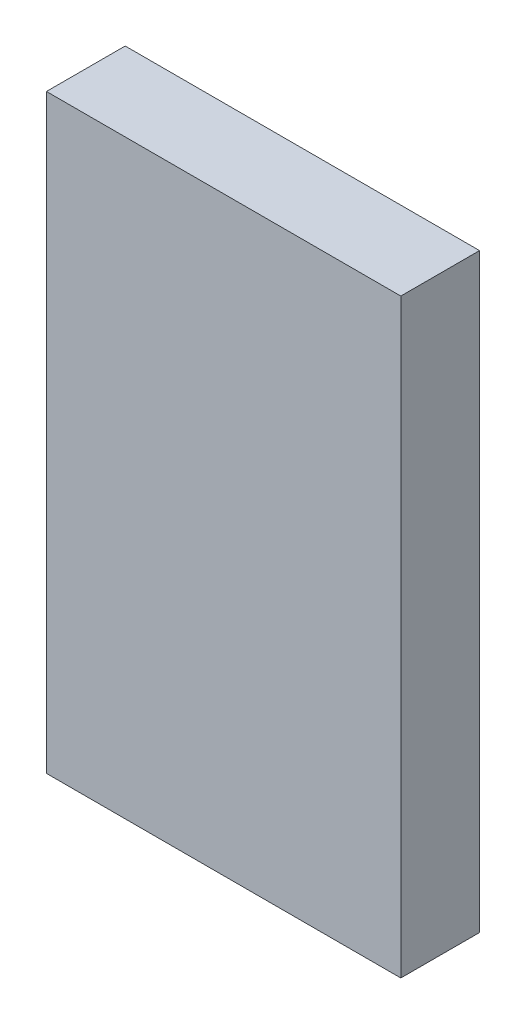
ISO-10303-21;
HEADER;
FILE_DESCRIPTION(('STEP AP214'),'2;1');
FILE_NAME('part.step','',(''),(''),'','','');
FILE_SCHEMA(('AUTOMOTIVE_DESIGN { 1 0 10303 214 1 1 1 1 }'));
ENDSEC;
DATA;
#1=APPLICATION_CONTEXT('core data for automotive mechanical design processes');
#2=APPLICATION_PROTOCOL_DEFINITION('international standard','automotive_design',2000,#1);
#3=PRODUCT_CONTEXT('',#1,'mechanical');
#4=PRODUCT('Part','Part','',(#3));
#5=PRODUCT_RELATED_PRODUCT_CATEGORY('part','',(#4));
#6=PRODUCT_DEFINITION_FORMATION('','',#4);
#7=PRODUCT_DEFINITION_CONTEXT('part definition',#1,'design');
#8=PRODUCT_DEFINITION('design','',#6,#7);
#9=PRODUCT_DEFINITION_SHAPE('','',#8);
#10=(LENGTH_UNIT() NAMED_UNIT(*) SI_UNIT(.MILLI.,.METRE.));
#11=(NAMED_UNIT(*) PLANE_ANGLE_UNIT() SI_UNIT($,.RADIAN.));
#12=(NAMED_UNIT(*) SI_UNIT($,.STERADIAN.) SOLID_ANGLE_UNIT());
#13=UNCERTAINTY_MEASURE_WITH_UNIT(LENGTH_MEASURE(1.E-05),#10,'distance_accuracy_value','');
#14=(GEOMETRIC_REPRESENTATION_CONTEXT(3) GLOBAL_UNCERTAINTY_ASSIGNED_CONTEXT((#13)) GLOBAL_UNIT_ASSIGNED_CONTEXT((#10,
#11,#12)) REPRESENTATION_CONTEXT('',''));
#15=CARTESIAN_POINT('',(0.,0.,0.));
#16=DIRECTION('',(0.,0.,1.));
#17=DIRECTION('',(1.,0.,0.));
#18=AXIS2_PLACEMENT_3D('',#15,#16,#17);
#19=CARTESIAN_POINT('',(0.,0.,20.));
#20=DIRECTION('',(0.,0.,1.));
#21=DIRECTION('',(1.,0.,0.));
#22=AXIS2_PLACEMENT_3D('',#19,#20,#21);
#23=PLANE('',#22);
#24=DIRECTION('',(1.,0.,0.));
#25=VECTOR('',#24,1.);
#26=CARTESIAN_POINT('',(-45.,-75.,20.));
#27=LINE('',#26,#25);
#28=CARTESIAN_POINT('',(-45.,-75.,20.));
#29=VERTEX_POINT('',#28);
#30=CARTESIAN_POINT('',(45.,-75.,20.));
#31=VERTEX_POINT('',#30);
#32=EDGE_CURVE('E92',#29,#31,#27,.T.);
#33=ORIENTED_EDGE('',*,*,#32,.T.);
#34=DIRECTION('',(0.,1.,0.));
#35=VECTOR('',#34,1.);
#36=CARTESIAN_POINT('',(45.,-75.,20.));
#37=LINE('',#36,#35);
#38=CARTESIAN_POINT('',(45.,75.,20.));
#39=VERTEX_POINT('',#38);
#40=EDGE_CURVE('E68',#31,#39,#37,.T.);
#41=ORIENTED_EDGE('',*,*,#40,.T.);
#42=DIRECTION('',(-1.,0.,0.));
#43=VECTOR('',#42,1.);
#44=CARTESIAN_POINT('',(45.,75.,20.));
#45=LINE('',#44,#43);
#46=CARTESIAN_POINT('',(-45.,75.,20.));
#47=VERTEX_POINT('',#46);
#48=EDGE_CURVE('E86',#39,#47,#45,.T.);
#49=ORIENTED_EDGE('',*,*,#48,.T.);
#50=DIRECTION('',(0.,-1.,0.));
#51=VECTOR('',#50,1.);
#52=CARTESIAN_POINT('',(-45.,75.,20.));
#53=LINE('',#52,#51);
#54=EDGE_CURVE('E10',#47,#29,#53,.T.);
#55=ORIENTED_EDGE('',*,*,#54,.T.);
#56=EDGE_LOOP('',(#33,#41,#49,#55));
#57=FACE_BOUND('',#56,.T.);
#58=ADVANCED_FACE('F16',(#57),#23,.T.);
#59=CARTESIAN_POINT('',(0.,0.,0.));
#60=DIRECTION('',(0.,0.,1.));
#61=DIRECTION('',(1.,0.,0.));
#62=AXIS2_PLACEMENT_3D('',#59,#60,#61);
#63=PLANE('',#62);
#64=DIRECTION('',(0.,-1.,0.));
#65=VECTOR('',#64,1.);
#66=CARTESIAN_POINT('',(-45.,75.,0.));
#67=LINE('',#66,#65);
#68=CARTESIAN_POINT('',(-45.,75.,0.));
#69=VERTEX_POINT('',#68);
#70=CARTESIAN_POINT('',(-45.,-75.,0.));
#71=VERTEX_POINT('',#70);
#72=EDGE_CURVE('E19',#69,#71,#67,.T.);
#73=ORIENTED_EDGE('',*,*,#72,.F.);
#74=DIRECTION('',(-1.,0.,0.));
#75=VECTOR('',#74,1.);
#76=CARTESIAN_POINT('',(45.,75.,0.));
#77=LINE('',#76,#75);
#78=CARTESIAN_POINT('',(45.,75.,0.));
#79=VERTEX_POINT('',#78);
#80=EDGE_CURVE('E104',#79,#69,#77,.T.);
#81=ORIENTED_EDGE('',*,*,#80,.F.);
#82=DIRECTION('',(0.,1.,0.));
#83=VECTOR('',#82,1.);
#84=CARTESIAN_POINT('',(45.,-75.,0.));
#85=LINE('',#84,#83);
#86=CARTESIAN_POINT('',(45.,-75.,0.));
#87=VERTEX_POINT('',#86);
#88=EDGE_CURVE('E73',#87,#79,#85,.T.);
#89=ORIENTED_EDGE('',*,*,#88,.F.);
#90=DIRECTION('',(1.,0.,0.));
#91=VECTOR('',#90,1.);
#92=CARTESIAN_POINT('',(-45.,-75.,0.));
#93=LINE('',#92,#91);
#94=EDGE_CURVE('E91',#71,#87,#93,.T.);
#95=ORIENTED_EDGE('',*,*,#94,.F.);
#96=EDGE_LOOP('',(#73,#81,#89,#95));
#97=FACE_BOUND('',#96,.T.);
#98=ADVANCED_FACE('F95',(#97),#63,.F.);
#99=CARTESIAN_POINT('',(-45.,75.,0.));
#100=DIRECTION('',(1.,0.,0.));
#101=DIRECTION('',(0.,1.,0.));
#102=AXIS2_PLACEMENT_3D('',#99,#100,#101);
#103=PLANE('',#102);
#104=ORIENTED_EDGE('',*,*,#72,.T.);
#105=DIRECTION('',(0.,0.,1.));
#106=VECTOR('',#105,1.);
#107=CARTESIAN_POINT('',(-45.,-75.,0.));
#108=LINE('',#107,#106);
#109=EDGE_CURVE('E80',#71,#29,#108,.T.);
#110=ORIENTED_EDGE('',*,*,#109,.T.);
#111=ORIENTED_EDGE('',*,*,#54,.F.);
#112=DIRECTION('',(0.,0.,1.));
#113=VECTOR('',#112,1.);
#114=CARTESIAN_POINT('',(-45.,75.,0.));
#115=LINE('',#114,#113);
#116=EDGE_CURVE('E83',#69,#47,#115,.T.);
#117=ORIENTED_EDGE('',*,*,#116,.F.);
#118=EDGE_LOOP('',(#104,#110,#111,#117));
#119=FACE_BOUND('',#118,.T.);
#120=ADVANCED_FACE('F79',(#119),#103,.F.);
#121=CARTESIAN_POINT('',(45.,75.,0.));
#122=DIRECTION('',(0.,-1.,0.));
#123=DIRECTION('',(0.,0.,-1.));
#124=AXIS2_PLACEMENT_3D('',#121,#122,#123);
#125=PLANE('',#124);
#126=ORIENTED_EDGE('',*,*,#80,.T.);
#127=ORIENTED_EDGE('',*,*,#116,.T.);
#128=ORIENTED_EDGE('',*,*,#48,.F.);
#129=DIRECTION('',(0.,0.,1.));
#130=VECTOR('',#129,1.);
#131=CARTESIAN_POINT('',(45.,75.,0.));
#132=LINE('',#131,#130);
#133=EDGE_CURVE('E105',#79,#39,#132,.T.);
#134=ORIENTED_EDGE('',*,*,#133,.F.);
#135=EDGE_LOOP('',(#126,#127,#128,#134));
#136=FACE_BOUND('',#135,.T.);
#137=ADVANCED_FACE('F120',(#136),#125,.F.);
#138=CARTESIAN_POINT('',(45.,-75.,0.));
#139=DIRECTION('',(-1.,0.,0.));
#140=DIRECTION('',(0.,0.,1.));
#141=AXIS2_PLACEMENT_3D('',#138,#139,#140);
#142=PLANE('',#141);
#143=ORIENTED_EDGE('',*,*,#88,.T.);
#144=ORIENTED_EDGE('',*,*,#133,.T.);
#145=ORIENTED_EDGE('',*,*,#40,.F.);
#146=DIRECTION('',(0.,0.,1.));
#147=VECTOR('',#146,1.);
#148=CARTESIAN_POINT('',(45.,-75.,0.));
#149=LINE('',#148,#147);
#150=EDGE_CURVE('E97',#87,#31,#149,.T.);
#151=ORIENTED_EDGE('',*,*,#150,.F.);
#152=EDGE_LOOP('',(#143,#144,#145,#151));
#153=FACE_BOUND('',#152,.T.);
#154=ADVANCED_FACE('F121',(#153),#142,.F.);
#155=CARTESIAN_POINT('',(-45.,-75.,0.));
#156=DIRECTION('',(0.,1.,0.));
#157=DIRECTION('',(1.,0.,0.));
#158=AXIS2_PLACEMENT_3D('',#155,#156,#157);
#159=PLANE('',#158);
#160=ORIENTED_EDGE('',*,*,#94,.T.);
#161=ORIENTED_EDGE('',*,*,#150,.T.);
#162=ORIENTED_EDGE('',*,*,#32,.F.);
#163=ORIENTED_EDGE('',*,*,#109,.F.);
#164=EDGE_LOOP('',(#160,#161,#162,#163));
#165=FACE_BOUND('',#164,.T.);
#166=ADVANCED_FACE('F89',(#165),#159,.F.);
#167=CLOSED_SHELL('',(#58,#98,#120,#137,#154,#166));
#168=MANIFOLD_SOLID_BREP('B1',#167);
#169=ADVANCED_BREP_SHAPE_REPRESENTATION('',(#18,#168),#14);
#170=SHAPE_DEFINITION_REPRESENTATION(#9,#169);
ENDSEC;
END-ISO-10303-21;
